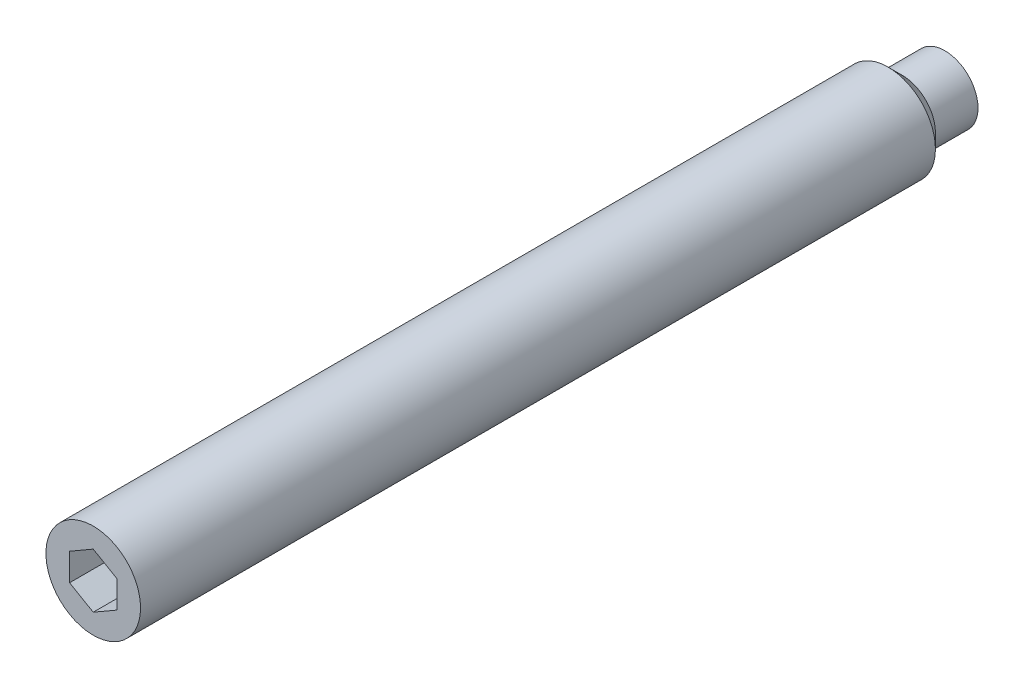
ISO-10303-21;
HEADER;
FILE_DESCRIPTION(('STEP AP214'),'2;1');
FILE_NAME('part.step','',(''),(''),'','','');
FILE_SCHEMA(('AUTOMOTIVE_DESIGN { 1 0 10303 214 1 1 1 1 }'));
ENDSEC;
DATA;
#1=APPLICATION_CONTEXT('core data for automotive mechanical design processes');
#2=APPLICATION_PROTOCOL_DEFINITION('international standard','automotive_design',2000,#1);
#3=PRODUCT_CONTEXT('',#1,'mechanical');
#4=PRODUCT('Part','Part','',(#3));
#5=PRODUCT_RELATED_PRODUCT_CATEGORY('part','',(#4));
#6=PRODUCT_DEFINITION_FORMATION('','',#4);
#7=PRODUCT_DEFINITION_CONTEXT('part definition',#1,'design');
#8=PRODUCT_DEFINITION('design','',#6,#7);
#9=PRODUCT_DEFINITION_SHAPE('','',#8);
#10=(LENGTH_UNIT() NAMED_UNIT(*) SI_UNIT(.MILLI.,.METRE.));
#11=(NAMED_UNIT(*) PLANE_ANGLE_UNIT() SI_UNIT($,.RADIAN.));
#12=(NAMED_UNIT(*) SI_UNIT($,.STERADIAN.) SOLID_ANGLE_UNIT());
#13=UNCERTAINTY_MEASURE_WITH_UNIT(LENGTH_MEASURE(1.E-05),#10,'distance_accuracy_value','');
#14=(GEOMETRIC_REPRESENTATION_CONTEXT(3) GLOBAL_UNCERTAINTY_ASSIGNED_CONTEXT((#13)) GLOBAL_UNIT_ASSIGNED_CONTEXT((#10,
#11,#12)) REPRESENTATION_CONTEXT('',''));
#15=CARTESIAN_POINT('',(0.,0.,0.));
#16=DIRECTION('',(0.,0.,1.));
#17=DIRECTION('',(1.,0.,0.));
#18=AXIS2_PLACEMENT_3D('',#15,#16,#17);
#19=CARTESIAN_POINT('',(0.,-2.88675134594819,86.));
#20=DIRECTION('',(0.5,0.86602540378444,0.));
#21=DIRECTION('',(-0.86602540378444,0.5,0.));
#22=AXIS2_PLACEMENT_3D('',#19,#20,#21);
#23=PLANE('',#22);
#24=DIRECTION('',(0.,0.,1.));
#25=VECTOR('',#24,1.);
#26=CARTESIAN_POINT('',(-2.50000000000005,-1.44337567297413,86.));
#27=LINE('',#26,#25);
#28=CARTESIAN_POINT('',(-2.50000000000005,-1.44337567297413,86.));
#29=VERTEX_POINT('',#28);
#30=CARTESIAN_POINT('',(-2.50000000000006,-1.44337567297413,90.));
#31=VERTEX_POINT('',#30);
#32=EDGE_CURVE('E63',#29,#31,#27,.T.);
#33=ORIENTED_EDGE('',*,*,#32,.T.);
#34=DIRECTION('',(-0.86602540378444,0.5,0.));
#35=VECTOR('',#34,1.);
#36=CARTESIAN_POINT('',(0.,-2.88675134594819,90.));
#37=LINE('',#36,#35);
#38=CARTESIAN_POINT('',(0.,-2.88675134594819,90.));
#39=VERTEX_POINT('',#38);
#40=EDGE_CURVE('E29',#39,#31,#37,.T.);
#41=ORIENTED_EDGE('',*,*,#40,.F.);
#42=DIRECTION('',(0.,0.,1.));
#43=VECTOR('',#42,1.);
#44=CARTESIAN_POINT('',(0.,-2.88675134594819,86.));
#45=LINE('',#44,#43);
#46=CARTESIAN_POINT('',(0.,-2.88675134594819,86.));
#47=VERTEX_POINT('',#46);
#48=EDGE_CURVE('E33',#47,#39,#45,.T.);
#49=ORIENTED_EDGE('',*,*,#48,.F.);
#50=DIRECTION('',(-0.86602540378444,0.5,0.));
#51=VECTOR('',#50,1.);
#52=CARTESIAN_POINT('',(0.,-2.88675134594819,86.));
#53=LINE('',#52,#51);
#54=EDGE_CURVE('E65',#47,#29,#53,.T.);
#55=ORIENTED_EDGE('',*,*,#54,.T.);
#56=EDGE_LOOP('',(#33,#41,#49,#55));
#57=FACE_BOUND('',#56,.T.);
#58=ADVANCED_FACE('F14',(#57),#23,.T.);
#59=CARTESIAN_POINT('',(-2.50000000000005,-1.44337567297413,86.));
#60=DIRECTION('',(1.,0.,0.));
#61=DIRECTION('',(0.,1.,0.));
#62=AXIS2_PLACEMENT_3D('',#59,#60,#61);
#63=PLANE('',#62);
#64=DIRECTION('',(0.,0.,1.));
#65=VECTOR('',#64,1.);
#66=CARTESIAN_POINT('',(-2.50000000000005,1.44337567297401,86.));
#67=LINE('',#66,#65);
#68=CARTESIAN_POINT('',(-2.50000000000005,1.44337567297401,86.));
#69=VERTEX_POINT('',#68);
#70=CARTESIAN_POINT('',(-2.50000000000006,1.44337567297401,90.));
#71=VERTEX_POINT('',#70);
#72=EDGE_CURVE('E70',#69,#71,#67,.T.);
#73=ORIENTED_EDGE('',*,*,#72,.T.);
#74=DIRECTION('',(0.,1.,0.));
#75=VECTOR('',#74,1.);
#76=CARTESIAN_POINT('',(-2.50000000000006,-1.44337567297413,90.));
#77=LINE('',#76,#75);
#78=EDGE_CURVE('E73',#31,#71,#77,.T.);
#79=ORIENTED_EDGE('',*,*,#78,.F.);
#80=ORIENTED_EDGE('',*,*,#32,.F.);
#81=DIRECTION('',(0.,1.,0.));
#82=VECTOR('',#81,1.);
#83=CARTESIAN_POINT('',(-2.50000000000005,-1.44337567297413,86.));
#84=LINE('',#83,#82);
#85=EDGE_CURVE('E99',#29,#69,#84,.T.);
#86=ORIENTED_EDGE('',*,*,#85,.T.);
#87=EDGE_LOOP('',(#73,#79,#80,#86));
#88=FACE_BOUND('',#87,.T.);
#89=ADVANCED_FACE('F74',(#88),#63,.T.);
#90=CARTESIAN_POINT('',(-2.50000000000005,1.44337567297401,86.));
#91=DIRECTION('',(0.5,-0.86602540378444,0.));
#92=DIRECTION('',(0.86602540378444,0.5,0.));
#93=AXIS2_PLACEMENT_3D('',#90,#91,#92);
#94=PLANE('',#93);
#95=DIRECTION('',(0.,0.,1.));
#96=VECTOR('',#95,1.);
#97=CARTESIAN_POINT('',(0.,2.88675134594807,86.));
#98=LINE('',#97,#96);
#99=CARTESIAN_POINT('',(0.,2.88675134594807,86.));
#100=VERTEX_POINT('',#99);
#101=CARTESIAN_POINT('',(0.,2.88675134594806,90.));
#102=VERTEX_POINT('',#101);
#103=EDGE_CURVE('E107',#100,#102,#98,.T.);
#104=ORIENTED_EDGE('',*,*,#103,.T.);
#105=DIRECTION('',(0.86602540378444,0.5,0.));
#106=VECTOR('',#105,1.);
#107=CARTESIAN_POINT('',(-2.50000000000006,1.44337567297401,90.));
#108=LINE('',#107,#106);
#109=EDGE_CURVE('E78',#71,#102,#108,.T.);
#110=ORIENTED_EDGE('',*,*,#109,.F.);
#111=ORIENTED_EDGE('',*,*,#72,.F.);
#112=DIRECTION('',(0.86602540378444,0.5,0.));
#113=VECTOR('',#112,1.);
#114=CARTESIAN_POINT('',(-2.50000000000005,1.44337567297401,86.));
#115=LINE('',#114,#113);
#116=EDGE_CURVE('E96',#69,#100,#115,.T.);
#117=ORIENTED_EDGE('',*,*,#116,.T.);
#118=EDGE_LOOP('',(#104,#110,#111,#117));
#119=FACE_BOUND('',#118,.T.);
#120=ADVANCED_FACE('F140',(#119),#94,.T.);
#121=CARTESIAN_POINT('',(2.49999999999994,1.44337567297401,86.));
#122=DIRECTION('',(0.5,0.86602540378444,0.));
#123=DIRECTION('',(-0.86602540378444,0.5,0.));
#124=AXIS2_PLACEMENT_3D('',#121,#122,#123);
#125=PLANE('',#124);
#126=DIRECTION('',(0.,0.,1.));
#127=VECTOR('',#126,1.);
#128=CARTESIAN_POINT('',(2.49999999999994,1.44337567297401,86.));
#129=LINE('',#128,#127);
#130=CARTESIAN_POINT('',(2.49999999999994,1.44337567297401,86.));
#131=VERTEX_POINT('',#130);
#132=CARTESIAN_POINT('',(2.49999999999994,1.44337567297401,90.));
#133=VERTEX_POINT('',#132);
#134=EDGE_CURVE('E105',#131,#133,#129,.T.);
#135=ORIENTED_EDGE('',*,*,#134,.T.);
#136=DIRECTION('',(-0.86602540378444,0.5,0.));
#137=VECTOR('',#136,1.);
#138=CARTESIAN_POINT('',(2.49999999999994,1.44337567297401,90.));
#139=LINE('',#138,#137);
#140=EDGE_CURVE('E248',#133,#102,#139,.T.);
#141=ORIENTED_EDGE('',*,*,#140,.T.);
#142=ORIENTED_EDGE('',*,*,#103,.F.);
#143=DIRECTION('',(-0.86602540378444,0.5,0.));
#144=VECTOR('',#143,1.);
#145=CARTESIAN_POINT('',(2.49999999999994,1.44337567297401,86.));
#146=LINE('',#145,#144);
#147=EDGE_CURVE('E93',#131,#100,#146,.T.);
#148=ORIENTED_EDGE('',*,*,#147,.F.);
#149=EDGE_LOOP('',(#135,#141,#142,#148));
#150=FACE_BOUND('',#149,.T.);
#151=ADVANCED_FACE('F152',(#150),#125,.F.);
#152=CARTESIAN_POINT('',(2.49999999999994,-1.44337567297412,86.));
#153=DIRECTION('',(1.,0.,0.));
#154=DIRECTION('',(0.,1.,0.));
#155=AXIS2_PLACEMENT_3D('',#152,#153,#154);
#156=PLANE('',#155);
#157=DIRECTION('',(0.,0.,1.));
#158=VECTOR('',#157,1.);
#159=CARTESIAN_POINT('',(2.49999999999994,-1.44337567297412,86.));
#160=LINE('',#159,#158);
#161=CARTESIAN_POINT('',(2.49999999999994,-1.44337567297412,86.));
#162=VERTEX_POINT('',#161);
#163=CARTESIAN_POINT('',(2.49999999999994,-1.44337567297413,90.));
#164=VERTEX_POINT('',#163);
#165=EDGE_CURVE('E103',#162,#164,#160,.T.);
#166=ORIENTED_EDGE('',*,*,#165,.T.);
#167=DIRECTION('',(0.,1.,0.));
#168=VECTOR('',#167,1.);
#169=CARTESIAN_POINT('',(2.49999999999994,-1.44337567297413,90.));
#170=LINE('',#169,#168);
#171=EDGE_CURVE('E249',#164,#133,#170,.T.);
#172=ORIENTED_EDGE('',*,*,#171,.T.);
#173=ORIENTED_EDGE('',*,*,#134,.F.);
#174=DIRECTION('',(0.,1.,0.));
#175=VECTOR('',#174,1.);
#176=CARTESIAN_POINT('',(2.49999999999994,-1.44337567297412,86.));
#177=LINE('',#176,#175);
#178=EDGE_CURVE('E90',#162,#131,#177,.T.);
#179=ORIENTED_EDGE('',*,*,#178,.F.);
#180=EDGE_LOOP('',(#166,#172,#173,#179));
#181=FACE_BOUND('',#180,.T.);
#182=ADVANCED_FACE('F148',(#181),#156,.F.);
#183=CARTESIAN_POINT('',(0.,-2.88675134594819,86.));
#184=DIRECTION('',(0.5,-0.866025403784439,0.));
#185=DIRECTION('',(0.866025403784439,0.5,0.));
#186=AXIS2_PLACEMENT_3D('',#183,#184,#185);
#187=PLANE('',#186);
#188=DIRECTION('',(0.866025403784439,0.5,0.));
#189=VECTOR('',#188,1.);
#190=CARTESIAN_POINT('',(0.,-2.88675134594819,86.));
#191=LINE('',#190,#189);
#192=EDGE_CURVE('E87',#47,#162,#191,.T.);
#193=ORIENTED_EDGE('',*,*,#192,.F.);
#194=ORIENTED_EDGE('',*,*,#48,.T.);
#195=DIRECTION('',(0.866025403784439,0.5,0.));
#196=VECTOR('',#195,1.);
#197=CARTESIAN_POINT('',(0.,-2.88675134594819,90.));
#198=LINE('',#197,#196);
#199=EDGE_CURVE('E83',#39,#164,#198,.T.);
#200=ORIENTED_EDGE('',*,*,#199,.T.);
#201=ORIENTED_EDGE('',*,*,#165,.F.);
#202=EDGE_LOOP('',(#193,#194,#200,#201));
#203=FACE_BOUND('',#202,.T.);
#204=ADVANCED_FACE('F145',(#203),#187,.F.);
#205=CARTESIAN_POINT('',(-2.50000000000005,-1.44337567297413,86.));
#206=DIRECTION('',(0.,0.,-1.));
#207=DIRECTION('',(-1.,0.,0.));
#208=AXIS2_PLACEMENT_3D('',#205,#206,#207);
#209=PLANE('',#208);
#210=ORIENTED_EDGE('',*,*,#54,.F.);
#211=ORIENTED_EDGE('',*,*,#192,.T.);
#212=ORIENTED_EDGE('',*,*,#178,.T.);
#213=ORIENTED_EDGE('',*,*,#147,.T.);
#214=ORIENTED_EDGE('',*,*,#116,.F.);
#215=ORIENTED_EDGE('',*,*,#85,.F.);
#216=EDGE_LOOP('',(#210,#211,#212,#213,#214,#215));
#217=FACE_BOUND('',#216,.T.);
#218=ADVANCED_FACE('F144',(#217),#209,.F.);
#219=CARTESIAN_POINT('',(0.,0.,90.));
#220=DIRECTION('',(0.,0.,1.));
#221=DIRECTION('',(1.,0.,0.));
#222=AXIS2_PLACEMENT_3D('',#219,#220,#221);
#223=PLANE('',#222);
#224=CARTESIAN_POINT('',(0.,0.,90.));
#225=DIRECTION('',(0.,0.,1.));
#226=DIRECTION('',(1.,0.,0.));
#227=AXIS2_PLACEMENT_3D('',#224,#225,#226);
#228=CIRCLE('',#227,5.);
#229=CARTESIAN_POINT('',(4.99999999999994,0.,90.));
#230=VERTEX_POINT('',#229);
#231=EDGE_CURVE('E9',#230,#230,#228,.T.);
#232=ORIENTED_EDGE('',*,*,#231,.T.);
#233=EDGE_LOOP('',(#232));
#234=FACE_BOUND('',#233,.T.);
#235=ORIENTED_EDGE('',*,*,#199,.F.);
#236=ORIENTED_EDGE('',*,*,#40,.T.);
#237=ORIENTED_EDGE('',*,*,#78,.T.);
#238=ORIENTED_EDGE('',*,*,#109,.T.);
#239=ORIENTED_EDGE('',*,*,#140,.F.);
#240=ORIENTED_EDGE('',*,*,#171,.F.);
#241=EDGE_LOOP('',(#235,#236,#237,#238,#239,#240));
#242=FACE_BOUND('',#241,.T.);
#243=ADVANCED_FACE('F16',(#234,#242),#223,.T.);
#244=CARTESIAN_POINT('',(0.,0.,80.));
#245=DIRECTION('',(0.,0.,1.));
#246=DIRECTION('',(1.,0.,0.));
#247=AXIS2_PLACEMENT_3D('',#244,#245,#246);
#248=CYLINDRICAL_SURFACE('',#247,5.);
#249=CARTESIAN_POINT('',(0.,0.,6.));
#250=DIRECTION('',(0.,0.,1.));
#251=DIRECTION('',(1.,0.,0.));
#252=AXIS2_PLACEMENT_3D('',#249,#250,#251);
#253=CIRCLE('',#252,5.);
#254=CARTESIAN_POINT('',(5.,0.,6.));
#255=VERTEX_POINT('',#254);
#256=EDGE_CURVE('E22',#255,#255,#253,.T.);
#257=ORIENTED_EDGE('',*,*,#256,.T.);
#258=EDGE_LOOP('',(#257));
#259=FACE_BOUND('',#258,.T.);
#260=ORIENTED_EDGE('',*,*,#231,.F.);
#261=EDGE_LOOP('',(#260));
#262=FACE_BOUND('',#261,.T.);
#263=ADVANCED_FACE('F117',(#259,#262),#248,.T.);
#264=CARTESIAN_POINT('',(0.,0.,6.));
#265=DIRECTION('',(0.,0.,1.));
#266=DIRECTION('',(1.,0.,0.));
#267=AXIS2_PLACEMENT_3D('',#264,#265,#266);
#268=CONICAL_SURFACE('',#267,5.,0.785398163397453);
#269=CARTESIAN_POINT('',(0.,0.,4.5));
#270=DIRECTION('',(0.,0.,1.));
#271=DIRECTION('',(1.,0.,0.));
#272=AXIS2_PLACEMENT_3D('',#269,#270,#271);
#273=CIRCLE('',#272,3.5);
#274=CARTESIAN_POINT('',(3.5,0.,4.5));
#275=VERTEX_POINT('',#274);
#276=EDGE_CURVE('E112',#275,#275,#273,.T.);
#277=ORIENTED_EDGE('',*,*,#276,.T.);
#278=EDGE_LOOP('',(#277));
#279=FACE_BOUND('',#278,.T.);
#280=ORIENTED_EDGE('',*,*,#256,.F.);
#281=EDGE_LOOP('',(#280));
#282=FACE_BOUND('',#281,.T.);
#283=ADVANCED_FACE('F120',(#279,#282),#268,.T.);
#284=CARTESIAN_POINT('',(0.,0.,80.));
#285=DIRECTION('',(0.,0.,1.));
#286=DIRECTION('',(1.,0.,0.));
#287=AXIS2_PLACEMENT_3D('',#284,#285,#286);
#288=CYLINDRICAL_SURFACE('',#287,3.5);
#289=CARTESIAN_POINT('',(0.,0.,0.));
#290=DIRECTION('',(0.,0.,1.));
#291=DIRECTION('',(1.,0.,0.));
#292=AXIS2_PLACEMENT_3D('',#289,#290,#291);
#293=CIRCLE('',#292,3.5);
#294=CARTESIAN_POINT('',(3.5,0.,0.));
#295=VERTEX_POINT('',#294);
#296=EDGE_CURVE('E69',#295,#295,#293,.T.);
#297=ORIENTED_EDGE('',*,*,#296,.T.);
#298=EDGE_LOOP('',(#297));
#299=FACE_BOUND('',#298,.T.);
#300=ORIENTED_EDGE('',*,*,#276,.F.);
#301=EDGE_LOOP('',(#300));
#302=FACE_BOUND('',#301,.T.);
#303=ADVANCED_FACE('F122',(#299,#302),#288,.T.);
#304=CARTESIAN_POINT('',(3.5,0.,0.));
#305=DIRECTION('',(0.,0.,-1.));
#306=DIRECTION('',(-1.,0.,0.));
#307=AXIS2_PLACEMENT_3D('',#304,#305,#306);
#308=PLANE('',#307);
#309=ORIENTED_EDGE('',*,*,#296,.F.);
#310=EDGE_LOOP('',(#309));
#311=FACE_BOUND('',#310,.T.);
#312=ADVANCED_FACE('F131',(#311),#308,.T.);
#313=CLOSED_SHELL('',(#58,#89,#120,#151,#182,#204,#218,#243,#263,#283,#303,#312));
#314=MANIFOLD_SOLID_BREP('B1',#313);
#315=ADVANCED_BREP_SHAPE_REPRESENTATION('',(#18,#314),#14);
#316=SHAPE_DEFINITION_REPRESENTATION(#9,#315);
ENDSEC;
END-ISO-10303-21;
